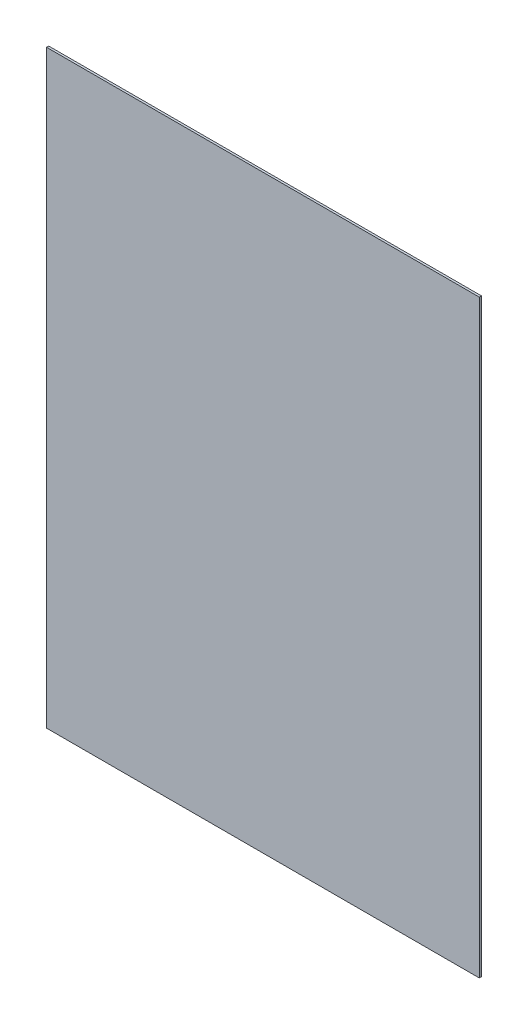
from build123d import *

# Parameters (mm, degrees)
SKIZZE1_W                       = 800
SKIZZE1_H                       = 1090
AUFSATZ_LINEAR_AUSTRAGEN1_DEPTH = 4


with BuildPart() as part:
    # Skizze1 → Aufsatz-Linear austragen1 (new body)
    with BuildSketch(Plane.XY):
        with Locations((400, 545)):
            Rectangle(SKIZZE1_W, SKIZZE1_H)
    extrude(amount=AUFSATZ_LINEAR_AUSTRAGEN1_DEPTH)


solid = part.part
